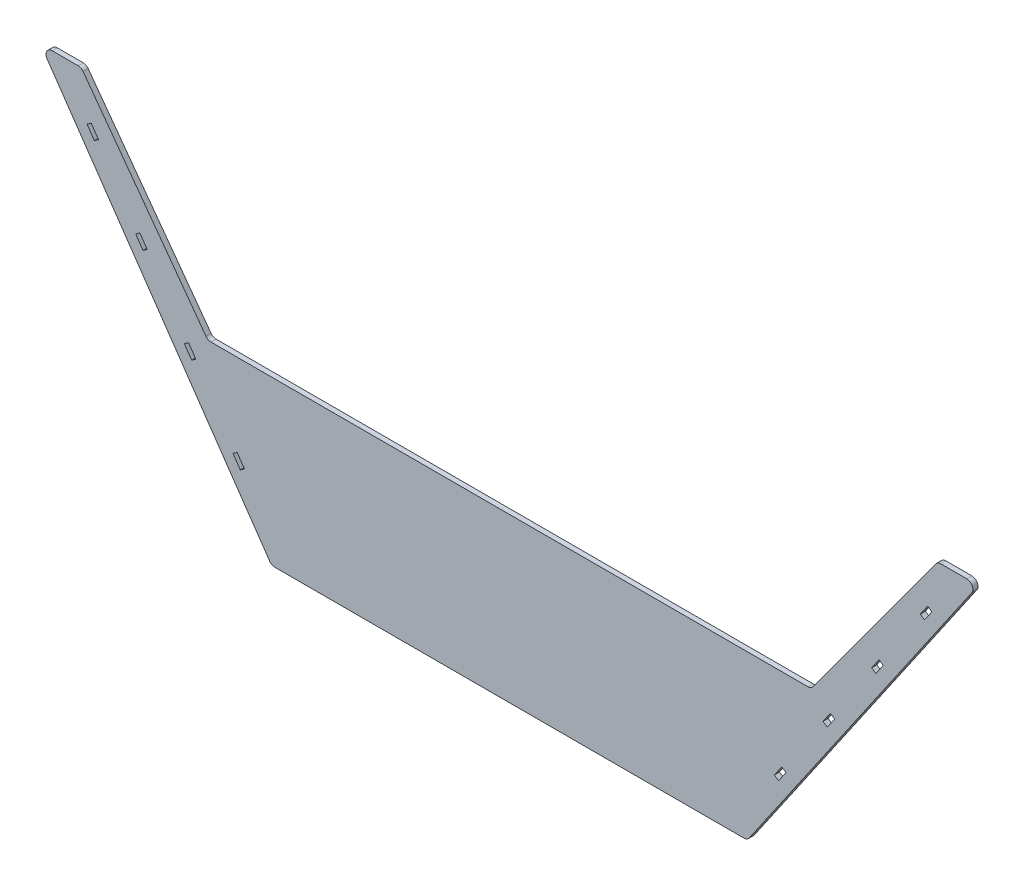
from build123d import *

# Parameters (mm, degrees)
EXTRUDE_1_DEPTH = 2.5
FILLET_2_R      = 3


with BuildPart() as part:
    # Sketch 1 → Extrude 1 (new body)
    with BuildSketch(Plane.XY):
        Polygon((-562.534071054, 35.211931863), (-675.869381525, 200), (-655.869381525, 200), (-593.784236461, 115.211931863), (-297.954526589, 115.211931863), (-235.869381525, 200), (-215.869381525, 200), (-329.204691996, 35.211931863), align=None)
        Polygon((-653.030093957, 177.380023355), (-649.448698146, 172.172720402), (-647.388847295, 173.589411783), (-650.970243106, 178.796714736), align=None, mode=Mode.SUBTRACT)
        Polygon((-629.173011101, 142.692135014), (-625.59161529, 137.484832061), (-623.531764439, 138.901523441), (-627.113160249, 144.108826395), align=None, mode=Mode.SUBTRACT)
        Polygon((-605.315928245, 108.004246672), (-601.734532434, 102.796943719), (-599.674681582, 104.2136351), (-603.256077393, 109.420938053), align=None, mode=Mode.SUBTRACT)
        Polygon((-581.458845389, 73.316358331), (-577.877449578, 68.109055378), (-575.817598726, 69.525746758), (-579.398994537, 74.733049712), align=None, mode=Mode.SUBTRACT)
        Polygon((-312.339768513, 74.733049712), (-315.921164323, 69.525746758), (-313.861313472, 68.109055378), (-310.279917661, 73.316358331), align=None, mode=Mode.SUBTRACT)
        Polygon((-288.482685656, 109.420938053), (-292.064081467, 104.2136351), (-290.004230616, 102.796943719), (-286.422834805, 108.004246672), align=None, mode=Mode.SUBTRACT)
        Polygon((-264.6256028, 144.108826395), (-268.206998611, 138.901523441), (-266.147147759, 137.484832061), (-262.565751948, 142.692135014), align=None, mode=Mode.SUBTRACT)
        Polygon((-240.768519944, 178.796714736), (-244.349915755, 173.589411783), (-242.290064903, 172.172720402), (-238.708669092, 177.380023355), align=None, mode=Mode.SUBTRACT)
    extrude(amount=EXTRUDE_1_DEPTH)

    # Fillet 2
    fillet_2_edges = [part.edges().sort_by_distance(p)[0] for p in [
        (-329.204691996, 35.211931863, 1.25),
        (-562.534071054, 35.211931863, 1.25),
        (-675.869381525, 200, 1.25),
        (-655.869381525, 200, 1.25),
        (-593.784236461, 115.211931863, 1.25),
        (-297.954526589, 115.211931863, 1.25),
        (-235.869381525, 200, 1.25),
        (-215.869381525, 200, 1.25),
    ]]
    fillet(fillet_2_edges, radius=FILLET_2_R)


solid = part.part
